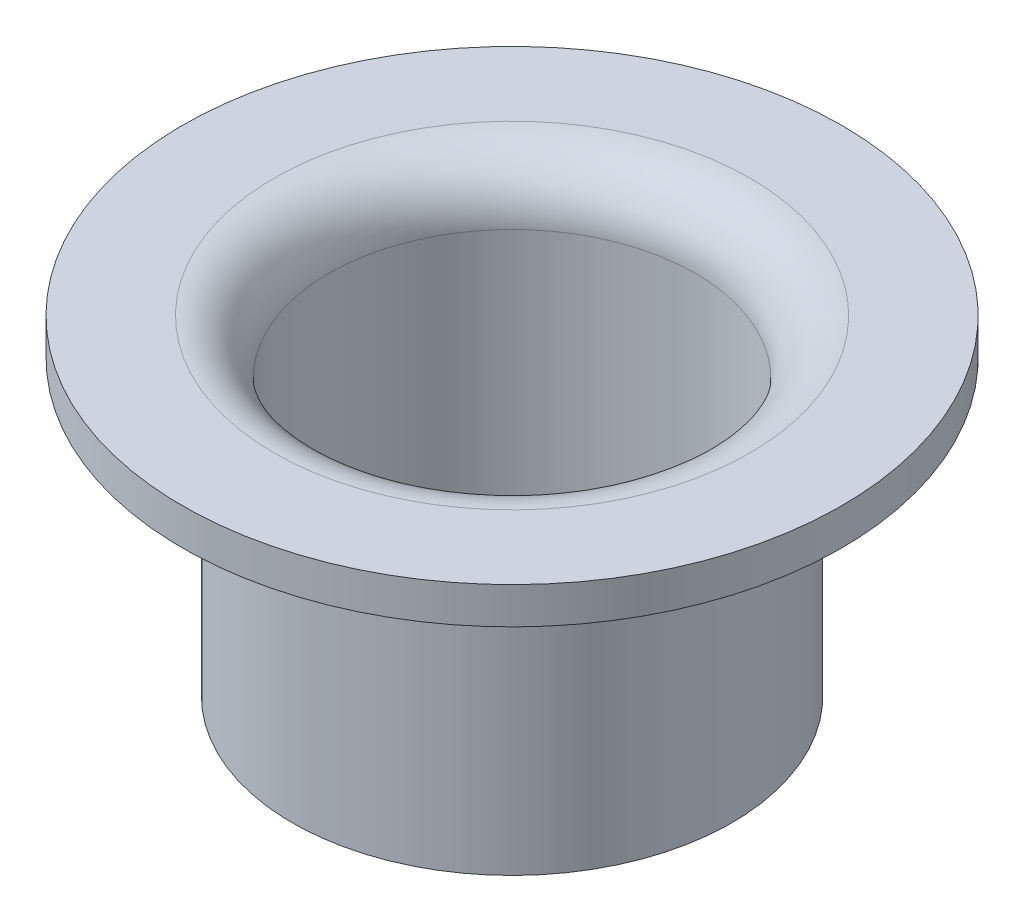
from build123d import *


with BuildPart() as part:
    # Esquisse2 → R_volution1 (revolve)
    with BuildSketch(Plane.XY, mode=Mode.PRIVATE) as r_volution1_sk:
        with BuildLine():
            Line((6, 30.645518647), (5, 30.645518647))
            Line((5, 30.645518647), (5, 38.145518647))
            ThreePointArc((5, 38.145518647), (5.439339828, 39.206178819), (6.5, 39.645518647))
            Line((6.5, 39.645518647), (9, 39.645518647))
            Line((9, 39.645518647), (9, 38.645518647))
            Line((9, 38.645518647), (6.5, 38.645518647))
            ThreePointArc((6.5, 38.645518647), (6.146446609, 38.499072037), (6, 38.145518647))
            Line((6, 38.145518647), (6, 30.645518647))
        make_face()
    revolve(r_volution1_sk.sketch.rotate(Axis((0, 0, 0), (0, 1, 0)), 90), axis=Axis((0, 0, 0), (0, 1, 0)))


solid = part.part
